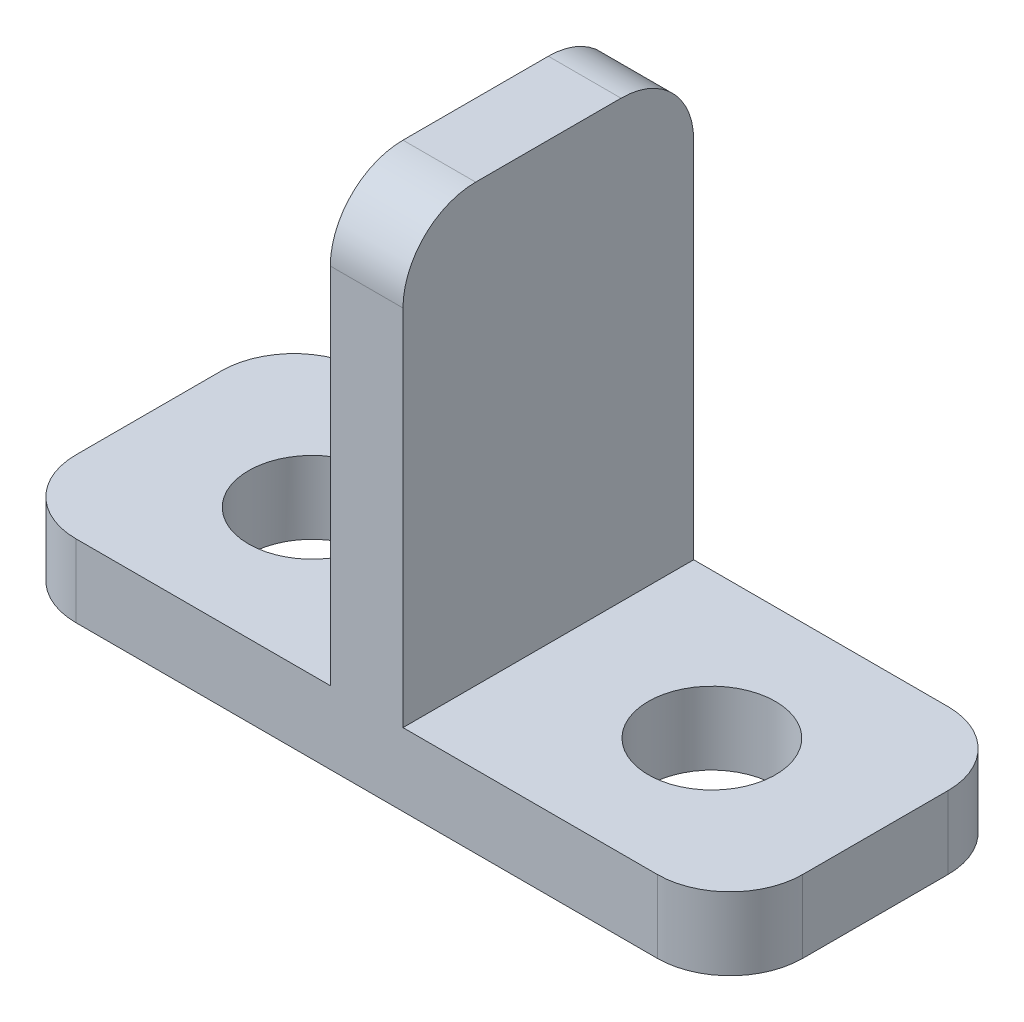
ISO-10303-21;
HEADER;
FILE_DESCRIPTION(('STEP AP214'),'2;1');
FILE_NAME('part.step','',(''),(''),'','','');
FILE_SCHEMA(('AUTOMOTIVE_DESIGN { 1 0 10303 214 1 1 1 1 }'));
ENDSEC;
DATA;
#1=APPLICATION_CONTEXT('core data for automotive mechanical design processes');
#2=APPLICATION_PROTOCOL_DEFINITION('international standard','automotive_design',2000,#1);
#3=PRODUCT_CONTEXT('',#1,'mechanical');
#4=PRODUCT('Part','Part','',(#3));
#5=PRODUCT_RELATED_PRODUCT_CATEGORY('part','',(#4));
#6=PRODUCT_DEFINITION_FORMATION('','',#4);
#7=PRODUCT_DEFINITION_CONTEXT('part definition',#1,'design');
#8=PRODUCT_DEFINITION('design','',#6,#7);
#9=PRODUCT_DEFINITION_SHAPE('','',#8);
#10=(LENGTH_UNIT() NAMED_UNIT(*) SI_UNIT(.MILLI.,.METRE.));
#11=(NAMED_UNIT(*) PLANE_ANGLE_UNIT() SI_UNIT($,.RADIAN.));
#12=(NAMED_UNIT(*) SI_UNIT($,.STERADIAN.) SOLID_ANGLE_UNIT());
#13=UNCERTAINTY_MEASURE_WITH_UNIT(LENGTH_MEASURE(1.E-05),#10,'distance_accuracy_value','');
#14=(GEOMETRIC_REPRESENTATION_CONTEXT(3) GLOBAL_UNCERTAINTY_ASSIGNED_CONTEXT((#13)) GLOBAL_UNIT_ASSIGNED_CONTEXT((#10,
#11,#12)) REPRESENTATION_CONTEXT('',''));
#15=CARTESIAN_POINT('',(0.,0.,0.));
#16=DIRECTION('',(0.,0.,1.));
#17=DIRECTION('',(1.,0.,0.));
#18=AXIS2_PLACEMENT_3D('',#15,#16,#17);
#19=CARTESIAN_POINT('',(0.,2.,0.));
#20=DIRECTION('',(0.,-1.,0.));
#21=DIRECTION('',(0.,0.,-1.));
#22=AXIS2_PLACEMENT_3D('',#19,#20,#21);
#23=PLANE('',#22);
#24=CARTESIAN_POINT('',(5.5,2.,0.));
#25=DIRECTION('',(0.,1.,0.));
#26=DIRECTION('',(0.,0.,-1.));
#27=AXIS2_PLACEMENT_3D('',#24,#25,#26);
#28=CIRCLE('',#27,1.75);
#29=CARTESIAN_POINT('',(5.5,2.,-1.75));
#30=VERTEX_POINT('',#29);
#31=EDGE_CURVE('E293',#30,#30,#28,.T.);
#32=ORIENTED_EDGE('',*,*,#31,.F.);
#33=EDGE_LOOP('',(#32));
#34=FACE_BOUND('',#33,.T.);
#35=DIRECTION('',(0.,0.,-1.));
#36=VECTOR('',#35,1.);
#37=CARTESIAN_POINT('',(10.,2.,4.));
#38=LINE('',#37,#36);
#39=CARTESIAN_POINT('',(10.,2.,2.));
#40=VERTEX_POINT('',#39);
#41=CARTESIAN_POINT('',(10.,2.,-2.));
#42=VERTEX_POINT('',#41);
#43=EDGE_CURVE('E179',#40,#42,#38,.T.);
#44=ORIENTED_EDGE('',*,*,#43,.T.);
#45=CARTESIAN_POINT('',(8.,2.,-2.));
#46=DIRECTION('',(0.,-1.,0.));
#47=DIRECTION('',(0.,0.,-1.));
#48=AXIS2_PLACEMENT_3D('',#45,#46,#47);
#49=CIRCLE('',#48,2.);
#50=CARTESIAN_POINT('',(8.,2.,-4.));
#51=VERTEX_POINT('',#50);
#52=EDGE_CURVE('E243',#42,#51,#49,.F.);
#53=ORIENTED_EDGE('',*,*,#52,.T.);
#54=DIRECTION('',(-1.,0.,0.));
#55=VECTOR('',#54,1.);
#56=CARTESIAN_POINT('',(-10.,2.,-4.));
#57=LINE('',#56,#55);
#58=CARTESIAN_POINT('',(1.,2.,-4.));
#59=VERTEX_POINT('',#58);
#60=EDGE_CURVE('E184',#51,#59,#57,.T.);
#61=ORIENTED_EDGE('',*,*,#60,.T.);
#62=DIRECTION('',(0.,0.,-1.));
#63=VECTOR('',#62,1.);
#64=CARTESIAN_POINT('',(1.,2.,4.));
#65=LINE('',#64,#63);
#66=CARTESIAN_POINT('',(1.,2.,4.));
#67=VERTEX_POINT('',#66);
#68=EDGE_CURVE('E163',#67,#59,#65,.T.);
#69=ORIENTED_EDGE('',*,*,#68,.F.);
#70=DIRECTION('',(1.,0.,0.));
#71=VECTOR('',#70,1.);
#72=CARTESIAN_POINT('',(-10.,2.,4.));
#73=LINE('',#72,#71);
#74=CARTESIAN_POINT('',(8.,2.,4.));
#75=VERTEX_POINT('',#74);
#76=EDGE_CURVE('E146',#67,#75,#73,.T.);
#77=ORIENTED_EDGE('',*,*,#76,.T.);
#78=CARTESIAN_POINT('',(8.,2.,2.));
#79=DIRECTION('',(0.,-1.,0.));
#80=DIRECTION('',(0.,0.,-1.));
#81=AXIS2_PLACEMENT_3D('',#78,#79,#80);
#82=CIRCLE('',#81,2.);
#83=EDGE_CURVE('E241',#75,#40,#82,.F.);
#84=ORIENTED_EDGE('',*,*,#83,.T.);
#85=EDGE_LOOP('',(#44,#53,#61,#69,#77,#84));
#86=FACE_BOUND('',#85,.T.);
#87=ADVANCED_FACE('F35',(#34,#86),#23,.F.);
#88=CARTESIAN_POINT('',(-5.5,2.,0.));
#89=DIRECTION('',(0.,1.,0.));
#90=DIRECTION('',(0.,0.,1.));
#91=AXIS2_PLACEMENT_3D('',#88,#89,#90);
#92=CIRCLE('',#91,1.75);
#93=CARTESIAN_POINT('',(-5.5,2.,1.75));
#94=VERTEX_POINT('',#93);
#95=EDGE_CURVE('E200',#94,#94,#92,.T.);
#96=ORIENTED_EDGE('',*,*,#95,.F.);
#97=EDGE_LOOP('',(#96));
#98=FACE_BOUND('',#97,.T.);
#99=DIRECTION('',(0.,0.,1.));
#100=VECTOR('',#99,1.);
#101=CARTESIAN_POINT('',(-10.,2.,4.));
#102=LINE('',#101,#100);
#103=CARTESIAN_POINT('',(-10.,2.,-2.));
#104=VERTEX_POINT('',#103);
#105=CARTESIAN_POINT('',(-10.,2.,2.));
#106=VERTEX_POINT('',#105);
#107=EDGE_CURVE('E186',#104,#106,#102,.T.);
#108=ORIENTED_EDGE('',*,*,#107,.T.);
#109=CARTESIAN_POINT('',(-8.,2.,2.));
#110=DIRECTION('',(0.,-1.,0.));
#111=DIRECTION('',(0.,0.,-1.));
#112=AXIS2_PLACEMENT_3D('',#109,#110,#111);
#113=CIRCLE('',#112,2.);
#114=CARTESIAN_POINT('',(-8.,2.,4.));
#115=VERTEX_POINT('',#114);
#116=EDGE_CURVE('E11',#106,#115,#113,.F.);
#117=ORIENTED_EDGE('',*,*,#116,.T.);
#118=CARTESIAN_POINT('',(-1.,2.,4.));
#119=VERTEX_POINT('',#118);
#120=EDGE_CURVE('E135',#115,#119,#73,.T.);
#121=ORIENTED_EDGE('',*,*,#120,.T.);
#122=DIRECTION('',(0.,0.,1.));
#123=VECTOR('',#122,1.);
#124=CARTESIAN_POINT('',(-1.,2.,4.));
#125=LINE('',#124,#123);
#126=CARTESIAN_POINT('',(-0.999999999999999,2.,-4.));
#127=VERTEX_POINT('',#126);
#128=EDGE_CURVE('E139',#127,#119,#125,.T.);
#129=ORIENTED_EDGE('',*,*,#128,.F.);
#130=CARTESIAN_POINT('',(-8.,2.,-4.));
#131=VERTEX_POINT('',#130);
#132=EDGE_CURVE('E182',#127,#131,#57,.T.);
#133=ORIENTED_EDGE('',*,*,#132,.T.);
#134=CARTESIAN_POINT('',(-8.,2.,-2.));
#135=DIRECTION('',(0.,-1.,0.));
#136=DIRECTION('',(0.,0.,-1.));
#137=AXIS2_PLACEMENT_3D('',#134,#135,#136);
#138=CIRCLE('',#137,2.);
#139=EDGE_CURVE('E43',#131,#104,#138,.F.);
#140=ORIENTED_EDGE('',*,*,#139,.T.);
#141=EDGE_LOOP('',(#108,#117,#121,#129,#133,#140));
#142=FACE_BOUND('',#141,.T.);
#143=ADVANCED_FACE('F137',(#98,#142),#23,.F.);
#144=CARTESIAN_POINT('',(10.,2.,4.));
#145=DIRECTION('',(-1.,0.,0.));
#146=DIRECTION('',(0.,0.,1.));
#147=AXIS2_PLACEMENT_3D('',#144,#145,#146);
#148=PLANE('',#147);
#149=DIRECTION('',(0.,0.,-1.));
#150=VECTOR('',#149,1.);
#151=CARTESIAN_POINT('',(10.,0.,4.));
#152=LINE('',#151,#150);
#153=CARTESIAN_POINT('',(10.,0.,2.));
#154=VERTEX_POINT('',#153);
#155=CARTESIAN_POINT('',(10.,0.,-2.));
#156=VERTEX_POINT('',#155);
#157=EDGE_CURVE('E178',#154,#156,#152,.T.);
#158=ORIENTED_EDGE('',*,*,#157,.T.);
#159=DIRECTION('',(0.,-1.,0.));
#160=VECTOR('',#159,1.);
#161=CARTESIAN_POINT('',(10.,2.,-2.));
#162=LINE('',#161,#160);
#163=EDGE_CURVE('E239',#156,#42,#162,.F.);
#164=ORIENTED_EDGE('',*,*,#163,.T.);
#165=ORIENTED_EDGE('',*,*,#43,.F.);
#166=DIRECTION('',(0.,-1.,0.));
#167=VECTOR('',#166,1.);
#168=CARTESIAN_POINT('',(10.,2.,2.));
#169=LINE('',#168,#167);
#170=EDGE_CURVE('E236',#40,#154,#169,.T.);
#171=ORIENTED_EDGE('',*,*,#170,.T.);
#172=EDGE_LOOP('',(#158,#164,#165,#171));
#173=FACE_BOUND('',#172,.T.);
#174=ADVANCED_FACE('F270',(#173),#148,.F.);
#175=CARTESIAN_POINT('',(-10.,2.,-4.));
#176=DIRECTION('',(0.,0.,1.));
#177=DIRECTION('',(1.,0.,0.));
#178=AXIS2_PLACEMENT_3D('',#175,#176,#177);
#179=PLANE('',#178);
#180=DIRECTION('',(0.,-1.,0.));
#181=VECTOR('',#180,1.);
#182=CARTESIAN_POINT('',(-1.,14.,-4.));
#183=LINE('',#182,#181);
#184=CARTESIAN_POINT('',(-1.,12.,-4.));
#185=VERTEX_POINT('',#184);
#186=EDGE_CURVE('E156',#185,#127,#183,.T.);
#187=ORIENTED_EDGE('',*,*,#186,.F.);
#188=DIRECTION('',(-1.,0.,0.));
#189=VECTOR('',#188,1.);
#190=CARTESIAN_POINT('',(-10.,12.,-4.));
#191=LINE('',#190,#189);
#192=CARTESIAN_POINT('',(1.,12.,-4.));
#193=VERTEX_POINT('',#192);
#194=EDGE_CURVE('E217',#185,#193,#191,.F.);
#195=ORIENTED_EDGE('',*,*,#194,.T.);
#196=DIRECTION('',(0.,-1.,0.));
#197=VECTOR('',#196,1.);
#198=CARTESIAN_POINT('',(1.,14.,-4.));
#199=LINE('',#198,#197);
#200=EDGE_CURVE('E175',#193,#59,#199,.T.);
#201=ORIENTED_EDGE('',*,*,#200,.T.);
#202=ORIENTED_EDGE('',*,*,#60,.F.);
#203=DIRECTION('',(0.,-1.,0.));
#204=VECTOR('',#203,1.);
#205=CARTESIAN_POINT('',(8.,2.,-4.));
#206=LINE('',#205,#204);
#207=CARTESIAN_POINT('',(8.,0.,-4.));
#208=VERTEX_POINT('',#207);
#209=EDGE_CURVE('E214',#51,#208,#206,.T.);
#210=ORIENTED_EDGE('',*,*,#209,.T.);
#211=DIRECTION('',(-1.,0.,0.));
#212=VECTOR('',#211,1.);
#213=CARTESIAN_POINT('',(-10.,0.,-4.));
#214=LINE('',#213,#212);
#215=CARTESIAN_POINT('',(-8.,0.,-4.));
#216=VERTEX_POINT('',#215);
#217=EDGE_CURVE('E190',#208,#216,#214,.T.);
#218=ORIENTED_EDGE('',*,*,#217,.T.);
#219=DIRECTION('',(0.,-1.,0.));
#220=VECTOR('',#219,1.);
#221=CARTESIAN_POINT('',(-8.,2.,-4.));
#222=LINE('',#221,#220);
#223=EDGE_CURVE('E212',#216,#131,#222,.F.);
#224=ORIENTED_EDGE('',*,*,#223,.T.);
#225=ORIENTED_EDGE('',*,*,#132,.F.);
#226=EDGE_LOOP('',(#187,#195,#201,#202,#210,#218,#224,#225));
#227=FACE_BOUND('',#226,.T.);
#228=ADVANCED_FACE('F278',(#227),#179,.F.);
#229=CARTESIAN_POINT('',(-10.,2.,4.));
#230=DIRECTION('',(1.,0.,0.));
#231=DIRECTION('',(0.,0.,-1.));
#232=AXIS2_PLACEMENT_3D('',#229,#230,#231);
#233=PLANE('',#232);
#234=DIRECTION('',(0.,0.,1.));
#235=VECTOR('',#234,1.);
#236=CARTESIAN_POINT('',(-10.,0.,4.));
#237=LINE('',#236,#235);
#238=CARTESIAN_POINT('',(-10.,0.,-2.));
#239=VERTEX_POINT('',#238);
#240=CARTESIAN_POINT('',(-10.,0.,2.));
#241=VERTEX_POINT('',#240);
#242=EDGE_CURVE('E193',#239,#241,#237,.T.);
#243=ORIENTED_EDGE('',*,*,#242,.T.);
#244=DIRECTION('',(0.,-1.,0.));
#245=VECTOR('',#244,1.);
#246=CARTESIAN_POINT('',(-10.,2.,2.));
#247=LINE('',#246,#245);
#248=EDGE_CURVE('E50',#241,#106,#247,.F.);
#249=ORIENTED_EDGE('',*,*,#248,.T.);
#250=ORIENTED_EDGE('',*,*,#107,.F.);
#251=DIRECTION('',(0.,-1.,0.));
#252=VECTOR('',#251,1.);
#253=CARTESIAN_POINT('',(-10.,2.,-2.));
#254=LINE('',#253,#252);
#255=EDGE_CURVE('E245',#104,#239,#254,.T.);
#256=ORIENTED_EDGE('',*,*,#255,.T.);
#257=EDGE_LOOP('',(#243,#249,#250,#256));
#258=FACE_BOUND('',#257,.T.);
#259=ADVANCED_FACE('F250',(#258),#233,.F.);
#260=CARTESIAN_POINT('',(-10.,2.,4.));
#261=DIRECTION('',(0.,0.,-1.));
#262=DIRECTION('',(-1.,0.,0.));
#263=AXIS2_PLACEMENT_3D('',#260,#261,#262);
#264=PLANE('',#263);
#265=DIRECTION('',(0.,-1.,0.));
#266=VECTOR('',#265,1.);
#267=CARTESIAN_POINT('',(1.,14.,4.));
#268=LINE('',#267,#266);
#269=CARTESIAN_POINT('',(1.,12.,4.));
#270=VERTEX_POINT('',#269);
#271=EDGE_CURVE('E157',#270,#67,#268,.T.);
#272=ORIENTED_EDGE('',*,*,#271,.F.);
#273=DIRECTION('',(1.,0.,0.));
#274=VECTOR('',#273,1.);
#275=CARTESIAN_POINT('',(-10.,12.,4.));
#276=LINE('',#275,#274);
#277=CARTESIAN_POINT('',(-1.,12.,4.));
#278=VERTEX_POINT('',#277);
#279=EDGE_CURVE('E153',#270,#278,#276,.F.);
#280=ORIENTED_EDGE('',*,*,#279,.T.);
#281=DIRECTION('',(0.,-1.,0.));
#282=VECTOR('',#281,1.);
#283=CARTESIAN_POINT('',(-1.,14.,4.));
#284=LINE('',#283,#282);
#285=EDGE_CURVE('E149',#278,#119,#284,.T.);
#286=ORIENTED_EDGE('',*,*,#285,.T.);
#287=ORIENTED_EDGE('',*,*,#120,.F.);
#288=DIRECTION('',(0.,-1.,0.));
#289=VECTOR('',#288,1.);
#290=CARTESIAN_POINT('',(-8.,2.,4.));
#291=LINE('',#290,#289);
#292=CARTESIAN_POINT('',(-8.,0.,4.));
#293=VERTEX_POINT('',#292);
#294=EDGE_CURVE('E223',#115,#293,#291,.T.);
#295=ORIENTED_EDGE('',*,*,#294,.T.);
#296=DIRECTION('',(1.,0.,0.));
#297=VECTOR('',#296,1.);
#298=CARTESIAN_POINT('',(-10.,0.,4.));
#299=LINE('',#298,#297);
#300=CARTESIAN_POINT('',(8.,0.,4.));
#301=VERTEX_POINT('',#300);
#302=EDGE_CURVE('E183',#293,#301,#299,.T.);
#303=ORIENTED_EDGE('',*,*,#302,.T.);
#304=DIRECTION('',(0.,-1.,0.));
#305=VECTOR('',#304,1.);
#306=CARTESIAN_POINT('',(8.,2.,4.));
#307=LINE('',#306,#305);
#308=EDGE_CURVE('E225',#301,#75,#307,.F.);
#309=ORIENTED_EDGE('',*,*,#308,.T.);
#310=ORIENTED_EDGE('',*,*,#76,.F.);
#311=EDGE_LOOP('',(#272,#280,#286,#287,#295,#303,#309,#310));
#312=FACE_BOUND('',#311,.T.);
#313=ADVANCED_FACE('F151',(#312),#264,.F.);
#314=CARTESIAN_POINT('',(0.,0.,0.));
#315=DIRECTION('',(0.,-1.,0.));
#316=DIRECTION('',(0.,0.,-1.));
#317=AXIS2_PLACEMENT_3D('',#314,#315,#316);
#318=PLANE('',#317);
#319=CARTESIAN_POINT('',(-5.5,0.,0.));
#320=DIRECTION('',(0.,-1.,0.));
#321=DIRECTION('',(0.,0.,-1.));
#322=AXIS2_PLACEMENT_3D('',#319,#320,#321);
#323=CIRCLE('',#322,1.75);
#324=CARTESIAN_POINT('',(-5.5,0.,-1.75));
#325=VERTEX_POINT('',#324);
#326=EDGE_CURVE('E169',#325,#325,#323,.T.);
#327=ORIENTED_EDGE('',*,*,#326,.F.);
#328=EDGE_LOOP('',(#327));
#329=FACE_BOUND('',#328,.T.);
#330=CARTESIAN_POINT('',(5.5,0.,0.));
#331=DIRECTION('',(0.,-1.,0.));
#332=DIRECTION('',(0.,0.,-1.));
#333=AXIS2_PLACEMENT_3D('',#330,#331,#332);
#334=CIRCLE('',#333,1.75);
#335=CARTESIAN_POINT('',(5.5,0.,-1.75));
#336=VERTEX_POINT('',#335);
#337=EDGE_CURVE('E197',#336,#336,#334,.T.);
#338=ORIENTED_EDGE('',*,*,#337,.F.);
#339=EDGE_LOOP('',(#338));
#340=FACE_BOUND('',#339,.T.);
#341=ORIENTED_EDGE('',*,*,#217,.F.);
#342=CARTESIAN_POINT('',(8.,0.,-2.));
#343=DIRECTION('',(0.,-1.,0.));
#344=DIRECTION('',(0.,0.,-1.));
#345=AXIS2_PLACEMENT_3D('',#342,#343,#344);
#346=CIRCLE('',#345,2.);
#347=EDGE_CURVE('E234',#208,#156,#346,.T.);
#348=ORIENTED_EDGE('',*,*,#347,.T.);
#349=ORIENTED_EDGE('',*,*,#157,.F.);
#350=CARTESIAN_POINT('',(8.,0.,2.));
#351=DIRECTION('',(0.,-1.,0.));
#352=DIRECTION('',(0.,0.,-1.));
#353=AXIS2_PLACEMENT_3D('',#350,#351,#352);
#354=CIRCLE('',#353,2.);
#355=EDGE_CURVE('E232',#154,#301,#354,.T.);
#356=ORIENTED_EDGE('',*,*,#355,.T.);
#357=ORIENTED_EDGE('',*,*,#302,.F.);
#358=CARTESIAN_POINT('',(-8.,0.,2.));
#359=DIRECTION('',(0.,-1.,0.));
#360=DIRECTION('',(0.,0.,-1.));
#361=AXIS2_PLACEMENT_3D('',#358,#359,#360);
#362=CIRCLE('',#361,2.);
#363=EDGE_CURVE('E230',#293,#241,#362,.T.);
#364=ORIENTED_EDGE('',*,*,#363,.T.);
#365=ORIENTED_EDGE('',*,*,#242,.F.);
#366=CARTESIAN_POINT('',(-8.,0.,-2.));
#367=DIRECTION('',(0.,-1.,0.));
#368=DIRECTION('',(0.,0.,-1.));
#369=AXIS2_PLACEMENT_3D('',#366,#367,#368);
#370=CIRCLE('',#369,2.);
#371=EDGE_CURVE('E228',#239,#216,#370,.T.);
#372=ORIENTED_EDGE('',*,*,#371,.T.);
#373=EDGE_LOOP('',(#341,#348,#349,#356,#357,#364,#365,#372));
#374=FACE_BOUND('',#373,.T.);
#375=ADVANCED_FACE('F254',(#329,#340,#374),#318,.T.);
#376=CARTESIAN_POINT('',(1.,14.,4.));
#377=DIRECTION('',(-1.,0.,0.));
#378=DIRECTION('',(0.,0.,1.));
#379=AXIS2_PLACEMENT_3D('',#376,#377,#378);
#380=PLANE('',#379);
#381=ORIENTED_EDGE('',*,*,#200,.F.);
#382=CARTESIAN_POINT('',(1.,12.,-2.));
#383=DIRECTION('',(-1.,0.,0.));
#384=DIRECTION('',(0.,0.,1.));
#385=AXIS2_PLACEMENT_3D('',#382,#383,#384);
#386=CIRCLE('',#385,2.);
#387=CARTESIAN_POINT('',(1.,14.,-2.));
#388=VERTEX_POINT('',#387);
#389=EDGE_CURVE('E221',#193,#388,#386,.F.);
#390=ORIENTED_EDGE('',*,*,#389,.T.);
#391=DIRECTION('',(0.,0.,-1.));
#392=VECTOR('',#391,1.);
#393=CARTESIAN_POINT('',(1.,14.,4.));
#394=LINE('',#393,#392);
#395=CARTESIAN_POINT('',(1.,14.,2.));
#396=VERTEX_POINT('',#395);
#397=EDGE_CURVE('E162',#396,#388,#394,.T.);
#398=ORIENTED_EDGE('',*,*,#397,.F.);
#399=CARTESIAN_POINT('',(1.,12.,2.));
#400=DIRECTION('',(-1.,0.,0.));
#401=DIRECTION('',(0.,0.,1.));
#402=AXIS2_PLACEMENT_3D('',#399,#400,#401);
#403=CIRCLE('',#402,2.);
#404=EDGE_CURVE('E219',#396,#270,#403,.F.);
#405=ORIENTED_EDGE('',*,*,#404,.T.);
#406=ORIENTED_EDGE('',*,*,#271,.T.);
#407=ORIENTED_EDGE('',*,*,#68,.T.);
#408=EDGE_LOOP('',(#381,#390,#398,#405,#406,#407));
#409=FACE_BOUND('',#408,.T.);
#410=ADVANCED_FACE('F283',(#409),#380,.F.);
#411=CARTESIAN_POINT('',(-1.,14.,4.));
#412=DIRECTION('',(1.,0.,0.));
#413=DIRECTION('',(0.,0.,-1.));
#414=AXIS2_PLACEMENT_3D('',#411,#412,#413);
#415=PLANE('',#414);
#416=DIRECTION('',(0.,0.,1.));
#417=VECTOR('',#416,1.);
#418=CARTESIAN_POINT('',(-1.,14.,4.));
#419=LINE('',#418,#417);
#420=CARTESIAN_POINT('',(-1.,14.,-2.));
#421=VERTEX_POINT('',#420);
#422=CARTESIAN_POINT('',(-1.,14.,2.));
#423=VERTEX_POINT('',#422);
#424=EDGE_CURVE('E166',#421,#423,#419,.T.);
#425=ORIENTED_EDGE('',*,*,#424,.F.);
#426=CARTESIAN_POINT('',(-1.,12.,-2.));
#427=DIRECTION('',(1.,0.,0.));
#428=DIRECTION('',(0.,0.,-1.));
#429=AXIS2_PLACEMENT_3D('',#426,#427,#428);
#430=CIRCLE('',#429,2.);
#431=EDGE_CURVE('E210',#421,#185,#430,.F.);
#432=ORIENTED_EDGE('',*,*,#431,.T.);
#433=ORIENTED_EDGE('',*,*,#186,.T.);
#434=ORIENTED_EDGE('',*,*,#128,.T.);
#435=ORIENTED_EDGE('',*,*,#285,.F.);
#436=CARTESIAN_POINT('',(-1.,12.,2.));
#437=DIRECTION('',(1.,0.,0.));
#438=DIRECTION('',(0.,0.,-1.));
#439=AXIS2_PLACEMENT_3D('',#436,#437,#438);
#440=CIRCLE('',#439,2.);
#441=EDGE_CURVE('E208',#278,#423,#440,.F.);
#442=ORIENTED_EDGE('',*,*,#441,.T.);
#443=EDGE_LOOP('',(#425,#432,#433,#434,#435,#442));
#444=FACE_BOUND('',#443,.T.);
#445=ADVANCED_FACE('F160',(#444),#415,.F.);
#446=CARTESIAN_POINT('',(0.,14.,0.));
#447=DIRECTION('',(0.,-1.,0.));
#448=DIRECTION('',(0.,0.,-1.));
#449=AXIS2_PLACEMENT_3D('',#446,#447,#448);
#450=PLANE('',#449);
#451=ORIENTED_EDGE('',*,*,#397,.T.);
#452=DIRECTION('',(-1.,0.,0.));
#453=VECTOR('',#452,1.);
#454=CARTESIAN_POINT('',(0.,14.,-2.));
#455=LINE('',#454,#453);
#456=EDGE_CURVE('E205',#388,#421,#455,.T.);
#457=ORIENTED_EDGE('',*,*,#456,.T.);
#458=ORIENTED_EDGE('',*,*,#424,.T.);
#459=DIRECTION('',(1.,0.,0.));
#460=VECTOR('',#459,1.);
#461=CARTESIAN_POINT('',(0.,14.,2.));
#462=LINE('',#461,#460);
#463=EDGE_CURVE('E145',#423,#396,#462,.T.);
#464=ORIENTED_EDGE('',*,*,#463,.T.);
#465=EDGE_LOOP('',(#451,#457,#458,#464));
#466=FACE_BOUND('',#465,.T.);
#467=ADVANCED_FACE('F289',(#466),#450,.F.);
#468=CARTESIAN_POINT('',(5.5,-8.,0.));
#469=DIRECTION('',(0.,1.,0.));
#470=DIRECTION('',(0.,0.,1.));
#471=AXIS2_PLACEMENT_3D('',#468,#469,#470);
#472=CYLINDRICAL_SURFACE('',#471,1.75);
#473=ORIENTED_EDGE('',*,*,#337,.T.);
#474=EDGE_LOOP('',(#473));
#475=FACE_BOUND('',#474,.T.);
#476=ORIENTED_EDGE('',*,*,#31,.T.);
#477=EDGE_LOOP('',(#476));
#478=FACE_BOUND('',#477,.T.);
#479=ADVANCED_FACE('F376',(#475,#478),#472,.F.);
#480=CARTESIAN_POINT('',(-5.5,-8.,0.));
#481=DIRECTION('',(0.,1.,0.));
#482=DIRECTION('',(0.,0.,1.));
#483=AXIS2_PLACEMENT_3D('',#480,#481,#482);
#484=CYLINDRICAL_SURFACE('',#483,1.75);
#485=ORIENTED_EDGE('',*,*,#326,.T.);
#486=EDGE_LOOP('',(#485));
#487=FACE_BOUND('',#486,.T.);
#488=ORIENTED_EDGE('',*,*,#95,.T.);
#489=EDGE_LOOP('',(#488));
#490=FACE_BOUND('',#489,.T.);
#491=ADVANCED_FACE('F299',(#487,#490),#484,.F.);
#492=CARTESIAN_POINT('',(0.,12.,-2.));
#493=DIRECTION('',(-1.,0.,0.));
#494=DIRECTION('',(0.,0.,1.));
#495=AXIS2_PLACEMENT_3D('',#492,#493,#494);
#496=CYLINDRICAL_SURFACE('',#495,2.);
#497=ORIENTED_EDGE('',*,*,#389,.F.);
#498=ORIENTED_EDGE('',*,*,#194,.F.);
#499=ORIENTED_EDGE('',*,*,#431,.F.);
#500=ORIENTED_EDGE('',*,*,#456,.F.);
#501=EDGE_LOOP('',(#497,#498,#499,#500));
#502=FACE_BOUND('',#501,.T.);
#503=ADVANCED_FACE('F321',(#502),#496,.T.);
#504=CARTESIAN_POINT('',(0.,12.,2.));
#505=DIRECTION('',(1.,0.,0.));
#506=DIRECTION('',(0.,0.,-1.));
#507=AXIS2_PLACEMENT_3D('',#504,#505,#506);
#508=CYLINDRICAL_SURFACE('',#507,2.);
#509=ORIENTED_EDGE('',*,*,#441,.F.);
#510=ORIENTED_EDGE('',*,*,#279,.F.);
#511=ORIENTED_EDGE('',*,*,#404,.F.);
#512=ORIENTED_EDGE('',*,*,#463,.F.);
#513=EDGE_LOOP('',(#509,#510,#511,#512));
#514=FACE_BOUND('',#513,.T.);
#515=ADVANCED_FACE('F285',(#514),#508,.T.);
#516=CARTESIAN_POINT('',(8.,2.,-2.));
#517=DIRECTION('',(0.,-1.,0.));
#518=DIRECTION('',(0.,0.,-1.));
#519=AXIS2_PLACEMENT_3D('',#516,#517,#518);
#520=CYLINDRICAL_SURFACE('',#519,2.);
#521=ORIENTED_EDGE('',*,*,#52,.F.);
#522=ORIENTED_EDGE('',*,*,#163,.F.);
#523=ORIENTED_EDGE('',*,*,#347,.F.);
#524=ORIENTED_EDGE('',*,*,#209,.F.);
#525=EDGE_LOOP('',(#521,#522,#523,#524));
#526=FACE_BOUND('',#525,.T.);
#527=ADVANCED_FACE('F274',(#526),#520,.T.);
#528=CARTESIAN_POINT('',(8.,2.,2.));
#529=DIRECTION('',(0.,-1.,0.));
#530=DIRECTION('',(0.,0.,-1.));
#531=AXIS2_PLACEMENT_3D('',#528,#529,#530);
#532=CYLINDRICAL_SURFACE('',#531,2.);
#533=ORIENTED_EDGE('',*,*,#83,.F.);
#534=ORIENTED_EDGE('',*,*,#308,.F.);
#535=ORIENTED_EDGE('',*,*,#355,.F.);
#536=ORIENTED_EDGE('',*,*,#170,.F.);
#537=EDGE_LOOP('',(#533,#534,#535,#536));
#538=FACE_BOUND('',#537,.T.);
#539=ADVANCED_FACE('F263',(#538),#532,.T.);
#540=CARTESIAN_POINT('',(-8.,2.,2.));
#541=DIRECTION('',(0.,-1.,0.));
#542=DIRECTION('',(0.,0.,-1.));
#543=AXIS2_PLACEMENT_3D('',#540,#541,#542);
#544=CYLINDRICAL_SURFACE('',#543,2.);
#545=ORIENTED_EDGE('',*,*,#116,.F.);
#546=ORIENTED_EDGE('',*,*,#248,.F.);
#547=ORIENTED_EDGE('',*,*,#363,.F.);
#548=ORIENTED_EDGE('',*,*,#294,.F.);
#549=EDGE_LOOP('',(#545,#546,#547,#548));
#550=FACE_BOUND('',#549,.T.);
#551=ADVANCED_FACE('F257',(#550),#544,.T.);
#552=CARTESIAN_POINT('',(-8.,2.,-2.));
#553=DIRECTION('',(0.,-1.,0.));
#554=DIRECTION('',(0.,0.,-1.));
#555=AXIS2_PLACEMENT_3D('',#552,#553,#554);
#556=CYLINDRICAL_SURFACE('',#555,2.);
#557=ORIENTED_EDGE('',*,*,#139,.F.);
#558=ORIENTED_EDGE('',*,*,#223,.F.);
#559=ORIENTED_EDGE('',*,*,#371,.F.);
#560=ORIENTED_EDGE('',*,*,#255,.F.);
#561=EDGE_LOOP('',(#557,#558,#559,#560));
#562=FACE_BOUND('',#561,.T.);
#563=ADVANCED_FACE('F37',(#562),#556,.T.);
#564=CLOSED_SHELL('',(#87,#143,#174,#228,#259,#313,#375,#410,#445,#467,#479,#491,#503,#515,#527,
#539,#551,#563));
#565=MANIFOLD_SOLID_BREP('B2',#564);
#566=ADVANCED_BREP_SHAPE_REPRESENTATION('',(#18,#565),#14);
#567=SHAPE_DEFINITION_REPRESENTATION(#9,#566);
ENDSEC;
END-ISO-10303-21;
